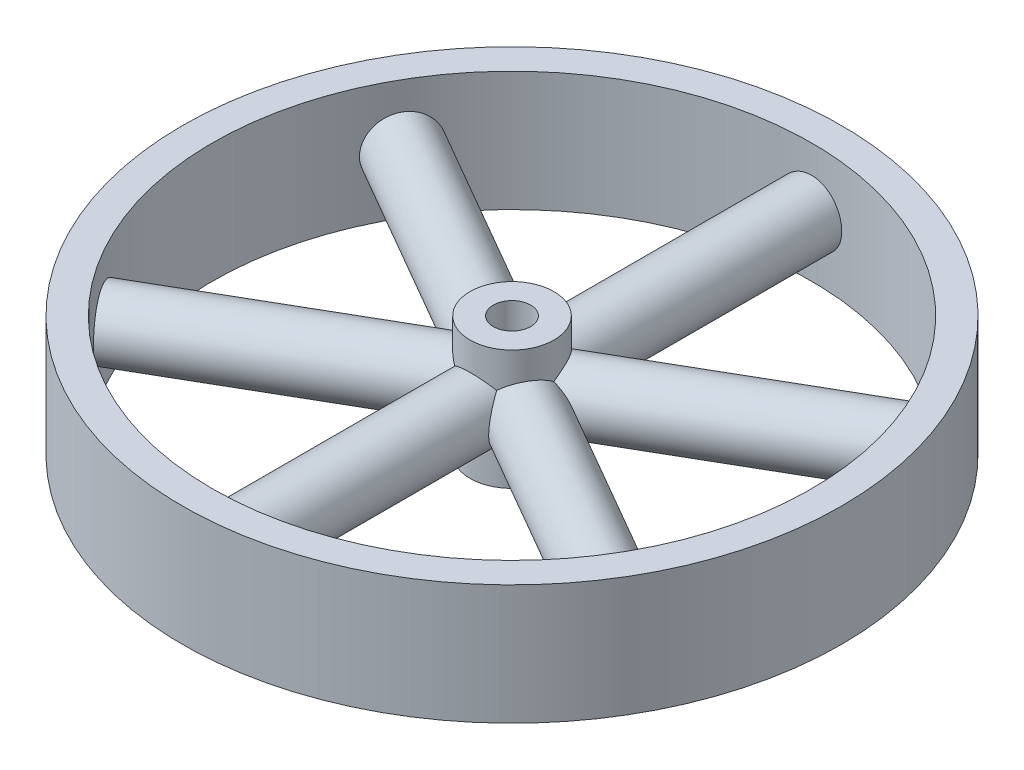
from build123d import *

# Parameters (mm, degrees)
SKETCH1_R           = 69.85
SKETCH1_R_2         = 63.5
EXTRUDE_THIN1_DEPTH = 12.7
SKETCH2_R           = 8.895106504
EXTRUDE2_DEPTH      = 12.7
EXTRUDE3_REACH      = 101.596
EXTRUDE3_END_RADIUS = 63.5
SKETCH3_R           = 6.745090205
CIRPATTERN2_COUNT   = 6
SKETCH4_R           = 3.961678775
CUT_EXTRUDE1_DEPTH  = 102.996102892


with BuildPart() as part:
    # Sketch1 → Extrude-Thin1 (new, symmetric)
    with BuildSketch(Plane(origin=(0, 0, 0), x_dir=(1, 0, 0), z_dir=(0, 1, 0))):
        Circle(SKETCH1_R)
        Circle(SKETCH1_R_2, mode=Mode.SUBTRACT)
    extrude(amount=EXTRUDE_THIN1_DEPTH, both=True)


with BuildPart() as body_2:
    # Sketch2 → Extrude2 (new, symmetric)
    with BuildSketch(Plane(origin=(0, 0, 0), x_dir=(1, 0, 0), z_dir=(0, 1, 0))):
        with Locations(Location((0, 0, 0), (0, 0, 270))):
            Circle(SKETCH2_R)
    extrude(amount=EXTRUDE2_DEPTH, both=True)

    # Extrude3: up to this cylinder (the profile starts inside it)
    extrude3_end = Plane(origin=(0, 0, 0), z_dir=(0, -1, 0)) * Cylinder(EXTRUDE3_END_RADIUS, 331.192, mode=Mode.PRIVATE)
    # Sketch3 → Extrude3 (add, up to the surface)
    with BuildSketch(Plane.XY, mode=Mode.PRIVATE) as extrude3_sk1:
        with Locations(Location((0, 0, 0), (0, 0, 180))):
            Circle(SKETCH3_R)
    extrude3_tool1 = extrude(extrude3_sk1.sketch, amount=EXTRUDE3_REACH, mode=Mode.PRIVATE) & extrude3_end
    extrude3 = extrude3_tool1.solids().sort_by_distance((0, 0, 0))[0]
    add(extrude3)


with BuildPart() as part_1:
    add(part.part)

    add(body_2.part)  # CirPattern2 merges body 2
    # CirPattern2: Extrude3 ×6 about axis
    cirpattern2_axis = Axis((0, 12.7, 0), (0, -1, 0))
    for i in range(1, CIRPATTERN2_COUNT):
        add(extrude3.rotate(cirpattern2_axis, i * 360 / CIRPATTERN2_COUNT))

    # Sketch4 → Cut-Extrude1 (cut, through all)
    with BuildSketch(Plane(origin=(0, 12.7, 0), x_dir=(-1, 0, 0), z_dir=(0, 1, 0))):
        with Locations(Location((0, 0, 0), (0, 0, 90))):
            Circle(SKETCH4_R)
    extrude(amount=-CUT_EXTRUDE1_DEPTH, mode=Mode.SUBTRACT)


solid = part_1.part
